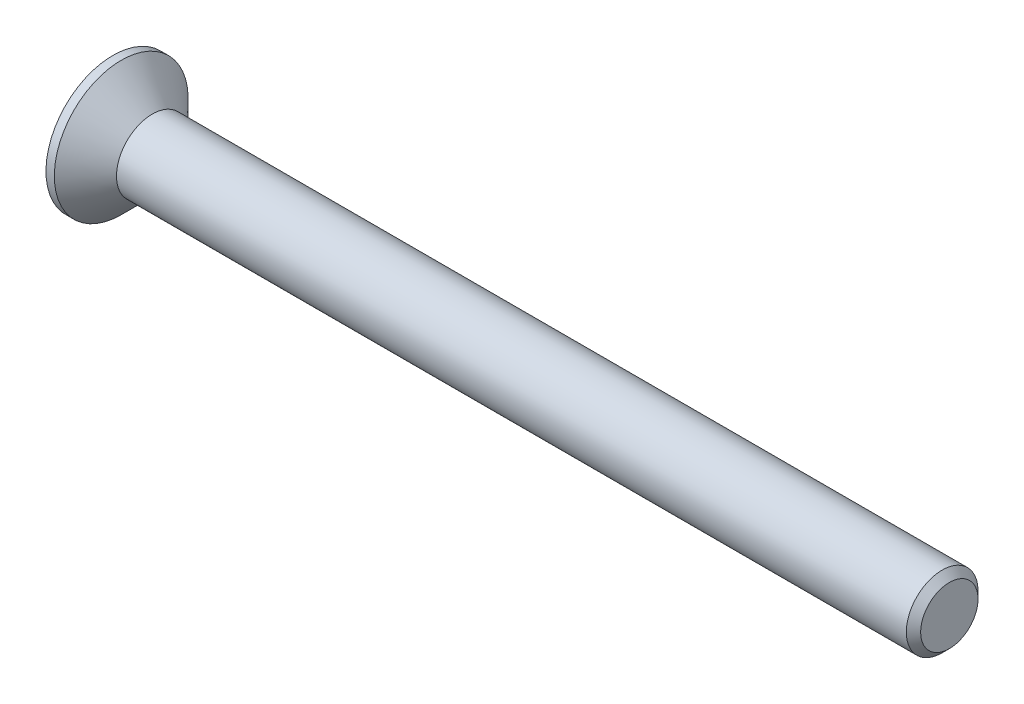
ISO-10303-21;
HEADER;
FILE_DESCRIPTION(('STEP AP214'),'2;1');
FILE_NAME('part.step','',(''),(''),'','','');
FILE_SCHEMA(('AUTOMOTIVE_DESIGN { 1 0 10303 214 1 1 1 1 }'));
ENDSEC;
DATA;
#1=APPLICATION_CONTEXT('core data for automotive mechanical design processes');
#2=APPLICATION_PROTOCOL_DEFINITION('international standard','automotive_design',2000,#1);
#3=PRODUCT_CONTEXT('',#1,'mechanical');
#4=PRODUCT('Part','Part','',(#3));
#5=PRODUCT_RELATED_PRODUCT_CATEGORY('part','',(#4));
#6=PRODUCT_DEFINITION_FORMATION('','',#4);
#7=PRODUCT_DEFINITION_CONTEXT('part definition',#1,'design');
#8=PRODUCT_DEFINITION('design','',#6,#7);
#9=PRODUCT_DEFINITION_SHAPE('','',#8);
#10=(LENGTH_UNIT() NAMED_UNIT(*) SI_UNIT(.MILLI.,.METRE.));
#11=(NAMED_UNIT(*) PLANE_ANGLE_UNIT() SI_UNIT($,.RADIAN.));
#12=(NAMED_UNIT(*) SI_UNIT($,.STERADIAN.) SOLID_ANGLE_UNIT());
#13=UNCERTAINTY_MEASURE_WITH_UNIT(LENGTH_MEASURE(1.E-05),#10,'distance_accuracy_value','');
#14=(GEOMETRIC_REPRESENTATION_CONTEXT(3) GLOBAL_UNCERTAINTY_ASSIGNED_CONTEXT((#13)) GLOBAL_UNIT_ASSIGNED_CONTEXT((#10,
#11,#12)) REPRESENTATION_CONTEXT('',''));
#15=CARTESIAN_POINT('',(0.,0.,0.));
#16=DIRECTION('',(0.,0.,1.));
#17=DIRECTION('',(1.,0.,0.));
#18=AXIS2_PLACEMENT_3D('',#15,#16,#17);
#19=CARTESIAN_POINT('',(0.,0.,0.));
#20=DIRECTION('',(-1.,0.,0.));
#21=DIRECTION('',(0.,-1.,0.));
#22=AXIS2_PLACEMENT_3D('',#19,#20,#21);
#23=CONICAL_SURFACE('',#22,1.5,0.78539816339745);
#24=CARTESIAN_POINT('',(-1.3,0.,0.));
#25=DIRECTION('',(-1.,0.,0.));
#26=DIRECTION('',(0.,-1.,0.));
#27=AXIS2_PLACEMENT_3D('',#24,#25,#26);
#28=CIRCLE('',#27,2.8);
#29=CARTESIAN_POINT('',(-1.3,-2.8,0.));
#30=VERTEX_POINT('',#29);
#31=EDGE_CURVE('E189',#30,#30,#28,.T.);
#32=ORIENTED_EDGE('',*,*,#31,.F.);
#33=EDGE_LOOP('',(#32));
#34=FACE_BOUND('',#33,.T.);
#35=CARTESIAN_POINT('',(0.,0.,0.));
#36=DIRECTION('',(-1.,0.,0.));
#37=DIRECTION('',(0.,-1.,0.));
#38=AXIS2_PLACEMENT_3D('',#35,#36,#37);
#39=CIRCLE('',#38,1.5);
#40=CARTESIAN_POINT('',(0.,-1.5,0.));
#41=VERTEX_POINT('',#40);
#42=EDGE_CURVE('E212',#41,#41,#39,.T.);
#43=ORIENTED_EDGE('',*,*,#42,.T.);
#44=EDGE_LOOP('',(#43));
#45=FACE_BOUND('',#44,.T.);
#46=ADVANCED_FACE('F33',(#34,#45),#23,.T.);
#47=CARTESIAN_POINT('',(-1.65,0.,0.));
#48=DIRECTION('',(-1.,0.,0.));
#49=DIRECTION('',(0.,-1.,0.));
#50=AXIS2_PLACEMENT_3D('',#47,#48,#49);
#51=CYLINDRICAL_SURFACE('',#50,1.5);
#52=CARTESIAN_POINT('',(33.05,0.,0.));
#53=DIRECTION('',(-1.,0.,0.));
#54=DIRECTION('',(0.,-1.,0.));
#55=AXIS2_PLACEMENT_3D('',#52,#53,#54);
#56=CIRCLE('',#55,1.5);
#57=CARTESIAN_POINT('',(33.05,-1.5,0.));
#58=VERTEX_POINT('',#57);
#59=EDGE_CURVE('E41',#58,#58,#56,.T.);
#60=ORIENTED_EDGE('',*,*,#59,.T.);
#61=EDGE_LOOP('',(#60));
#62=FACE_BOUND('',#61,.T.);
#63=ORIENTED_EDGE('',*,*,#42,.F.);
#64=EDGE_LOOP('',(#63));
#65=FACE_BOUND('',#64,.T.);
#66=ADVANCED_FACE('F217',(#62,#65),#51,.T.);
#67=CARTESIAN_POINT('',(33.35,0.,0.));
#68=DIRECTION('',(-1.,0.,0.));
#69=DIRECTION('',(0.,-1.,0.));
#70=AXIS2_PLACEMENT_3D('',#67,#68,#69);
#71=PLANE('',#70);
#72=CARTESIAN_POINT('',(33.35,0.,0.));
#73=DIRECTION('',(-1.,0.,0.));
#74=DIRECTION('',(0.,-1.,0.));
#75=AXIS2_PLACEMENT_3D('',#72,#73,#74);
#76=CIRCLE('',#75,1.20000000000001);
#77=CARTESIAN_POINT('',(33.35,-1.20000000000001,0.));
#78=VERTEX_POINT('',#77);
#79=EDGE_CURVE('E11',#78,#78,#76,.F.);
#80=ORIENTED_EDGE('',*,*,#79,.T.);
#81=EDGE_LOOP('',(#80));
#82=FACE_BOUND('',#81,.T.);
#83=ADVANCED_FACE('F239',(#82),#71,.F.);
#84=CARTESIAN_POINT('',(-1.65,2.8,0.));
#85=DIRECTION('',(1.,0.,0.));
#86=DIRECTION('',(0.,1.,0.));
#87=AXIS2_PLACEMENT_3D('',#84,#85,#86);
#88=PLANE('',#87);
#89=DIRECTION('',(0.,0.,-1.));
#90=VECTOR('',#89,1.);
#91=CARTESIAN_POINT('',(-1.65,0.365,-1.45));
#92=LINE('',#91,#90);
#93=CARTESIAN_POINT('',(-1.65,0.365,-0.365));
#94=VERTEX_POINT('',#93);
#95=CARTESIAN_POINT('',(-1.65,0.365,-1.45));
#96=VERTEX_POINT('',#95);
#97=EDGE_CURVE('E158',#94,#96,#92,.T.);
#98=ORIENTED_EDGE('',*,*,#97,.F.);
#99=DIRECTION('',(0.,-1.,0.));
#100=VECTOR('',#99,1.);
#101=CARTESIAN_POINT('',(-1.65,0.365,-0.365));
#102=LINE('',#101,#100);
#103=CARTESIAN_POINT('',(-1.65,1.45,-0.365));
#104=VERTEX_POINT('',#103);
#105=EDGE_CURVE('E48',#104,#94,#102,.T.);
#106=ORIENTED_EDGE('',*,*,#105,.F.);
#107=DIRECTION('',(0.,0.,-1.));
#108=VECTOR('',#107,1.);
#109=CARTESIAN_POINT('',(-1.65,1.45,-0.365));
#110=LINE('',#109,#108);
#111=CARTESIAN_POINT('',(-1.65,1.45,0.365));
#112=VERTEX_POINT('',#111);
#113=EDGE_CURVE('E185',#112,#104,#110,.T.);
#114=ORIENTED_EDGE('',*,*,#113,.F.);
#115=DIRECTION('',(0.,1.,0.));
#116=VECTOR('',#115,1.);
#117=CARTESIAN_POINT('',(-1.65,1.45,0.365));
#118=LINE('',#117,#116);
#119=CARTESIAN_POINT('',(-1.65,0.365,0.365));
#120=VERTEX_POINT('',#119);
#121=EDGE_CURVE('E183',#120,#112,#118,.T.);
#122=ORIENTED_EDGE('',*,*,#121,.F.);
#123=DIRECTION('',(0.,0.,-1.));
#124=VECTOR('',#123,1.);
#125=CARTESIAN_POINT('',(-1.65,0.365,0.365));
#126=LINE('',#125,#124);
#127=CARTESIAN_POINT('',(-1.65,0.365,1.45));
#128=VERTEX_POINT('',#127);
#129=EDGE_CURVE('E132',#128,#120,#126,.T.);
#130=ORIENTED_EDGE('',*,*,#129,.F.);
#131=DIRECTION('',(0.,1.,0.));
#132=VECTOR('',#131,1.);
#133=CARTESIAN_POINT('',(-1.65,0.365,1.45));
#134=LINE('',#133,#132);
#135=CARTESIAN_POINT('',(-1.65,-0.365,1.45));
#136=VERTEX_POINT('',#135);
#137=EDGE_CURVE('E179',#136,#128,#134,.T.);
#138=ORIENTED_EDGE('',*,*,#137,.F.);
#139=DIRECTION('',(0.,0.,1.));
#140=VECTOR('',#139,1.);
#141=CARTESIAN_POINT('',(-1.65,-0.365,1.45));
#142=LINE('',#141,#140);
#143=CARTESIAN_POINT('',(-1.65,-0.365,0.365));
#144=VERTEX_POINT('',#143);
#145=EDGE_CURVE('E176',#144,#136,#142,.T.);
#146=ORIENTED_EDGE('',*,*,#145,.F.);
#147=DIRECTION('',(0.,1.,0.));
#148=VECTOR('',#147,1.);
#149=CARTESIAN_POINT('',(-1.65,-0.365,0.365));
#150=LINE('',#149,#148);
#151=CARTESIAN_POINT('',(-1.65,-1.45,0.365));
#152=VERTEX_POINT('',#151);
#153=EDGE_CURVE('E173',#152,#144,#150,.T.);
#154=ORIENTED_EDGE('',*,*,#153,.F.);
#155=DIRECTION('',(0.,0.,1.));
#156=VECTOR('',#155,1.);
#157=CARTESIAN_POINT('',(-1.65,-1.45,0.365));
#158=LINE('',#157,#156);
#159=CARTESIAN_POINT('',(-1.65,-1.45,-0.365));
#160=VERTEX_POINT('',#159);
#161=EDGE_CURVE('E170',#160,#152,#158,.T.);
#162=ORIENTED_EDGE('',*,*,#161,.F.);
#163=DIRECTION('',(0.,-1.,0.));
#164=VECTOR('',#163,1.);
#165=CARTESIAN_POINT('',(-1.65,-1.45,-0.365));
#166=LINE('',#165,#164);
#167=CARTESIAN_POINT('',(-1.65,-0.365,-0.365));
#168=VERTEX_POINT('',#167);
#169=EDGE_CURVE('E167',#168,#160,#166,.T.);
#170=ORIENTED_EDGE('',*,*,#169,.F.);
#171=DIRECTION('',(0.,0.,1.));
#172=VECTOR('',#171,1.);
#173=CARTESIAN_POINT('',(-1.65,-0.365,-0.365));
#174=LINE('',#173,#172);
#175=CARTESIAN_POINT('',(-1.65,-0.365,-1.45));
#176=VERTEX_POINT('',#175);
#177=EDGE_CURVE('E164',#176,#168,#174,.T.);
#178=ORIENTED_EDGE('',*,*,#177,.F.);
#179=DIRECTION('',(0.,-1.,0.));
#180=VECTOR('',#179,1.);
#181=CARTESIAN_POINT('',(-1.65,-0.365,-1.45));
#182=LINE('',#181,#180);
#183=EDGE_CURVE('E161',#96,#176,#182,.T.);
#184=ORIENTED_EDGE('',*,*,#183,.F.);
#185=EDGE_LOOP('',(#98,#106,#114,#122,#130,#138,#146,#154,#162,#170,#178,#184));
#186=FACE_BOUND('',#185,.T.);
#187=CARTESIAN_POINT('',(-1.65,0.,0.));
#188=DIRECTION('',(-1.,0.,0.));
#189=DIRECTION('',(0.,-1.,0.));
#190=AXIS2_PLACEMENT_3D('',#187,#188,#189);
#191=CIRCLE('',#190,2.8);
#192=CARTESIAN_POINT('',(-1.65,-2.8,0.));
#193=VERTEX_POINT('',#192);
#194=EDGE_CURVE('E209',#193,#193,#191,.T.);
#195=ORIENTED_EDGE('',*,*,#194,.T.);
#196=EDGE_LOOP('',(#195));
#197=FACE_BOUND('',#196,.T.);
#198=ADVANCED_FACE('F230',(#186,#197),#88,.F.);
#199=CARTESIAN_POINT('',(-1.65,0.,0.));
#200=DIRECTION('',(-1.,0.,0.));
#201=DIRECTION('',(0.,-1.,0.));
#202=AXIS2_PLACEMENT_3D('',#199,#200,#201);
#203=CYLINDRICAL_SURFACE('',#202,2.8);
#204=ORIENTED_EDGE('',*,*,#194,.F.);
#205=EDGE_LOOP('',(#204));
#206=FACE_BOUND('',#205,.T.);
#207=ORIENTED_EDGE('',*,*,#31,.T.);
#208=EDGE_LOOP('',(#207));
#209=FACE_BOUND('',#208,.T.);
#210=ADVANCED_FACE('F222',(#206,#209),#203,.T.);
#211=CARTESIAN_POINT('',(33.05,0.,0.));
#212=DIRECTION('',(-1.,0.,0.));
#213=DIRECTION('',(0.,-1.,0.));
#214=AXIS2_PLACEMENT_3D('',#211,#212,#213);
#215=CONICAL_SURFACE('',#214,1.5,0.785398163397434);
#216=ORIENTED_EDGE('',*,*,#79,.F.);
#217=EDGE_LOOP('',(#216));
#218=FACE_BOUND('',#217,.T.);
#219=ORIENTED_EDGE('',*,*,#59,.F.);
#220=EDGE_LOOP('',(#219));
#221=FACE_BOUND('',#220,.T.);
#222=ADVANCED_FACE('F35',(#218,#221),#215,.T.);
#223=CARTESIAN_POINT('',(-0.4,0.365,-0.365));
#224=DIRECTION('',(0.,0.,-1.));
#225=DIRECTION('',(-1.,0.,0.));
#226=AXIS2_PLACEMENT_3D('',#223,#224,#225);
#227=PLANE('',#226);
#228=ORIENTED_EDGE('',*,*,#105,.T.);
#229=DIRECTION('',(-1.,0.,0.));
#230=VECTOR('',#229,1.);
#231=CARTESIAN_POINT('',(-0.4,0.365,-0.365));
#232=LINE('',#231,#230);
#233=CARTESIAN_POINT('',(-0.4,0.365,-0.365));
#234=VERTEX_POINT('',#233);
#235=EDGE_CURVE('E96',#234,#94,#232,.T.);
#236=ORIENTED_EDGE('',*,*,#235,.F.);
#237=DIRECTION('',(0.,-1.,0.));
#238=VECTOR('',#237,1.);
#239=CARTESIAN_POINT('',(-0.4,0.365,-0.365));
#240=LINE('',#239,#238);
#241=CARTESIAN_POINT('',(-0.4,1.45,-0.365));
#242=VERTEX_POINT('',#241);
#243=EDGE_CURVE('E187',#242,#234,#240,.T.);
#244=ORIENTED_EDGE('',*,*,#243,.F.);
#245=DIRECTION('',(-1.,0.,0.));
#246=VECTOR('',#245,1.);
#247=CARTESIAN_POINT('',(-0.4,1.45,-0.365));
#248=LINE('',#247,#246);
#249=EDGE_CURVE('E56',#242,#104,#248,.T.);
#250=ORIENTED_EDGE('',*,*,#249,.T.);
#251=EDGE_LOOP('',(#228,#236,#244,#250));
#252=FACE_BOUND('',#251,.T.);
#253=ADVANCED_FACE('F221',(#252),#227,.F.);
#254=CARTESIAN_POINT('',(-0.4,1.45,-0.365));
#255=DIRECTION('',(0.,1.,0.));
#256=DIRECTION('',(-1.,0.,0.));
#257=AXIS2_PLACEMENT_3D('',#254,#255,#256);
#258=PLANE('',#257);
#259=ORIENTED_EDGE('',*,*,#113,.T.);
#260=ORIENTED_EDGE('',*,*,#249,.F.);
#261=DIRECTION('',(0.,0.,-1.));
#262=VECTOR('',#261,1.);
#263=CARTESIAN_POINT('',(-0.4,1.45,-0.365));
#264=LINE('',#263,#262);
#265=CARTESIAN_POINT('',(-0.4,1.45,0.365));
#266=VERTEX_POINT('',#265);
#267=EDGE_CURVE('E144',#266,#242,#264,.T.);
#268=ORIENTED_EDGE('',*,*,#267,.F.);
#269=DIRECTION('',(-1.,0.,0.));
#270=VECTOR('',#269,1.);
#271=CARTESIAN_POINT('',(-0.4,1.45,0.365));
#272=LINE('',#271,#270);
#273=EDGE_CURVE('E136',#266,#112,#272,.T.);
#274=ORIENTED_EDGE('',*,*,#273,.T.);
#275=EDGE_LOOP('',(#259,#260,#268,#274));
#276=FACE_BOUND('',#275,.T.);
#277=ADVANCED_FACE('F228',(#276),#258,.F.);
#278=CARTESIAN_POINT('',(-0.4,1.45,0.365));
#279=DIRECTION('',(0.,0.,1.));
#280=DIRECTION('',(1.,0.,0.));
#281=AXIS2_PLACEMENT_3D('',#278,#279,#280);
#282=PLANE('',#281);
#283=ORIENTED_EDGE('',*,*,#121,.T.);
#284=ORIENTED_EDGE('',*,*,#273,.F.);
#285=DIRECTION('',(0.,1.,0.));
#286=VECTOR('',#285,1.);
#287=CARTESIAN_POINT('',(-0.4,1.45,0.365));
#288=LINE('',#287,#286);
#289=CARTESIAN_POINT('',(-0.4,0.365,0.365));
#290=VERTEX_POINT('',#289);
#291=EDGE_CURVE('E140',#290,#266,#288,.T.);
#292=ORIENTED_EDGE('',*,*,#291,.F.);
#293=DIRECTION('',(-1.,0.,0.));
#294=VECTOR('',#293,1.);
#295=CARTESIAN_POINT('',(-0.4,0.365,0.365));
#296=LINE('',#295,#294);
#297=EDGE_CURVE('E125',#290,#120,#296,.T.);
#298=ORIENTED_EDGE('',*,*,#297,.T.);
#299=EDGE_LOOP('',(#283,#284,#292,#298));
#300=FACE_BOUND('',#299,.T.);
#301=ADVANCED_FACE('F141',(#300),#282,.F.);
#302=CARTESIAN_POINT('',(-0.4,0.365,0.365));
#303=DIRECTION('',(0.,1.,0.));
#304=DIRECTION('',(-1.,0.,0.));
#305=AXIS2_PLACEMENT_3D('',#302,#303,#304);
#306=PLANE('',#305);
#307=ORIENTED_EDGE('',*,*,#129,.T.);
#308=ORIENTED_EDGE('',*,*,#297,.F.);
#309=DIRECTION('',(0.,0.,-1.));
#310=VECTOR('',#309,1.);
#311=CARTESIAN_POINT('',(-0.4,0.365,0.365));
#312=LINE('',#311,#310);
#313=CARTESIAN_POINT('',(-0.4,0.365,1.45));
#314=VERTEX_POINT('',#313);
#315=EDGE_CURVE('E129',#314,#290,#312,.T.);
#316=ORIENTED_EDGE('',*,*,#315,.F.);
#317=DIRECTION('',(-1.,0.,0.));
#318=VECTOR('',#317,1.);
#319=CARTESIAN_POINT('',(-0.4,0.365,1.45));
#320=LINE('',#319,#318);
#321=EDGE_CURVE('E137',#314,#128,#320,.T.);
#322=ORIENTED_EDGE('',*,*,#321,.T.);
#323=EDGE_LOOP('',(#307,#308,#316,#322));
#324=FACE_BOUND('',#323,.T.);
#325=ADVANCED_FACE('F127',(#324),#306,.F.);
#326=CARTESIAN_POINT('',(-0.4,0.365,1.45));
#327=DIRECTION('',(0.,0.,1.));
#328=DIRECTION('',(1.,0.,0.));
#329=AXIS2_PLACEMENT_3D('',#326,#327,#328);
#330=PLANE('',#329);
#331=ORIENTED_EDGE('',*,*,#137,.T.);
#332=ORIENTED_EDGE('',*,*,#321,.F.);
#333=DIRECTION('',(0.,1.,0.));
#334=VECTOR('',#333,1.);
#335=CARTESIAN_POINT('',(-0.4,0.365,1.45));
#336=LINE('',#335,#334);
#337=CARTESIAN_POINT('',(-0.4,-0.365,1.45));
#338=VERTEX_POINT('',#337);
#339=EDGE_CURVE('E150',#338,#314,#336,.T.);
#340=ORIENTED_EDGE('',*,*,#339,.F.);
#341=DIRECTION('',(-1.,0.,0.));
#342=VECTOR('',#341,1.);
#343=CARTESIAN_POINT('',(-0.4,-0.365,1.45));
#344=LINE('',#343,#342);
#345=EDGE_CURVE('E192',#338,#136,#344,.T.);
#346=ORIENTED_EDGE('',*,*,#345,.T.);
#347=EDGE_LOOP('',(#331,#332,#340,#346));
#348=FACE_BOUND('',#347,.T.);
#349=ADVANCED_FACE('F277',(#348),#330,.F.);
#350=CARTESIAN_POINT('',(-0.4,-0.365,1.45));
#351=DIRECTION('',(0.,-1.,0.));
#352=DIRECTION('',(1.,0.,0.));
#353=AXIS2_PLACEMENT_3D('',#350,#351,#352);
#354=PLANE('',#353);
#355=ORIENTED_EDGE('',*,*,#145,.T.);
#356=ORIENTED_EDGE('',*,*,#345,.F.);
#357=DIRECTION('',(0.,0.,1.));
#358=VECTOR('',#357,1.);
#359=CARTESIAN_POINT('',(-0.4,-0.365,1.45));
#360=LINE('',#359,#358);
#361=CARTESIAN_POINT('',(-0.4,-0.365,0.365));
#362=VERTEX_POINT('',#361);
#363=EDGE_CURVE('E152',#362,#338,#360,.T.);
#364=ORIENTED_EDGE('',*,*,#363,.F.);
#365=DIRECTION('',(-1.,0.,0.));
#366=VECTOR('',#365,1.);
#367=CARTESIAN_POINT('',(-0.4,-0.365,0.365));
#368=LINE('',#367,#366);
#369=EDGE_CURVE('E194',#362,#144,#368,.T.);
#370=ORIENTED_EDGE('',*,*,#369,.T.);
#371=EDGE_LOOP('',(#355,#356,#364,#370));
#372=FACE_BOUND('',#371,.T.);
#373=ADVANCED_FACE('F273',(#372),#354,.F.);
#374=CARTESIAN_POINT('',(-0.4,-0.365,0.365));
#375=DIRECTION('',(0.,0.,1.));
#376=DIRECTION('',(1.,0.,0.));
#377=AXIS2_PLACEMENT_3D('',#374,#375,#376);
#378=PLANE('',#377);
#379=ORIENTED_EDGE('',*,*,#153,.T.);
#380=ORIENTED_EDGE('',*,*,#369,.F.);
#381=DIRECTION('',(0.,1.,0.));
#382=VECTOR('',#381,1.);
#383=CARTESIAN_POINT('',(-0.4,-0.365,0.365));
#384=LINE('',#383,#382);
#385=CARTESIAN_POINT('',(-0.4,-1.45,0.365));
#386=VERTEX_POINT('',#385);
#387=EDGE_CURVE('E422',#386,#362,#384,.T.);
#388=ORIENTED_EDGE('',*,*,#387,.F.);
#389=DIRECTION('',(-1.,0.,0.));
#390=VECTOR('',#389,1.);
#391=CARTESIAN_POINT('',(-0.4,-1.45,0.365));
#392=LINE('',#391,#390);
#393=EDGE_CURVE('E196',#386,#152,#392,.T.);
#394=ORIENTED_EDGE('',*,*,#393,.T.);
#395=EDGE_LOOP('',(#379,#380,#388,#394));
#396=FACE_BOUND('',#395,.T.);
#397=ADVANCED_FACE('F269',(#396),#378,.F.);
#398=CARTESIAN_POINT('',(-0.4,-1.45,0.365));
#399=DIRECTION('',(0.,-1.,0.));
#400=DIRECTION('',(1.,0.,0.));
#401=AXIS2_PLACEMENT_3D('',#398,#399,#400);
#402=PLANE('',#401);
#403=ORIENTED_EDGE('',*,*,#161,.T.);
#404=ORIENTED_EDGE('',*,*,#393,.F.);
#405=DIRECTION('',(0.,0.,1.));
#406=VECTOR('',#405,1.);
#407=CARTESIAN_POINT('',(-0.4,-1.45,0.365));
#408=LINE('',#407,#406);
#409=CARTESIAN_POINT('',(-0.4,-1.45,-0.365));
#410=VERTEX_POINT('',#409);
#411=EDGE_CURVE('E419',#410,#386,#408,.T.);
#412=ORIENTED_EDGE('',*,*,#411,.F.);
#413=DIRECTION('',(-1.,0.,0.));
#414=VECTOR('',#413,1.);
#415=CARTESIAN_POINT('',(-0.4,-1.45,-0.365));
#416=LINE('',#415,#414);
#417=EDGE_CURVE('E198',#410,#160,#416,.T.);
#418=ORIENTED_EDGE('',*,*,#417,.T.);
#419=EDGE_LOOP('',(#403,#404,#412,#418));
#420=FACE_BOUND('',#419,.T.);
#421=ADVANCED_FACE('F265',(#420),#402,.F.);
#422=CARTESIAN_POINT('',(-0.4,-1.45,-0.365));
#423=DIRECTION('',(0.,0.,-1.));
#424=DIRECTION('',(-1.,0.,0.));
#425=AXIS2_PLACEMENT_3D('',#422,#423,#424);
#426=PLANE('',#425);
#427=ORIENTED_EDGE('',*,*,#169,.T.);
#428=ORIENTED_EDGE('',*,*,#417,.F.);
#429=DIRECTION('',(0.,-1.,0.));
#430=VECTOR('',#429,1.);
#431=CARTESIAN_POINT('',(-0.4,-1.45,-0.365));
#432=LINE('',#431,#430);
#433=CARTESIAN_POINT('',(-0.4,-0.365,-0.365));
#434=VERTEX_POINT('',#433);
#435=EDGE_CURVE('E416',#434,#410,#432,.T.);
#436=ORIENTED_EDGE('',*,*,#435,.F.);
#437=DIRECTION('',(-1.,0.,0.));
#438=VECTOR('',#437,1.);
#439=CARTESIAN_POINT('',(-0.4,-0.365,-0.365));
#440=LINE('',#439,#438);
#441=EDGE_CURVE('E200',#434,#168,#440,.T.);
#442=ORIENTED_EDGE('',*,*,#441,.T.);
#443=EDGE_LOOP('',(#427,#428,#436,#442));
#444=FACE_BOUND('',#443,.T.);
#445=ADVANCED_FACE('F261',(#444),#426,.F.);
#446=CARTESIAN_POINT('',(-0.4,-0.365,-0.365));
#447=DIRECTION('',(0.,-1.,0.));
#448=DIRECTION('',(1.,0.,0.));
#449=AXIS2_PLACEMENT_3D('',#446,#447,#448);
#450=PLANE('',#449);
#451=ORIENTED_EDGE('',*,*,#177,.T.);
#452=ORIENTED_EDGE('',*,*,#441,.F.);
#453=DIRECTION('',(0.,0.,1.));
#454=VECTOR('',#453,1.);
#455=CARTESIAN_POINT('',(-0.4,-0.365,-0.365));
#456=LINE('',#455,#454);
#457=CARTESIAN_POINT('',(-0.4,-0.365,-1.45));
#458=VERTEX_POINT('',#457);
#459=EDGE_CURVE('E413',#458,#434,#456,.T.);
#460=ORIENTED_EDGE('',*,*,#459,.F.);
#461=DIRECTION('',(-1.,0.,0.));
#462=VECTOR('',#461,1.);
#463=CARTESIAN_POINT('',(-0.4,-0.365,-1.45));
#464=LINE('',#463,#462);
#465=EDGE_CURVE('E202',#458,#176,#464,.T.);
#466=ORIENTED_EDGE('',*,*,#465,.T.);
#467=EDGE_LOOP('',(#451,#452,#460,#466));
#468=FACE_BOUND('',#467,.T.);
#469=ADVANCED_FACE('F257',(#468),#450,.F.);
#470=CARTESIAN_POINT('',(-0.4,-0.365,-1.45));
#471=DIRECTION('',(0.,0.,-1.));
#472=DIRECTION('',(-1.,0.,0.));
#473=AXIS2_PLACEMENT_3D('',#470,#471,#472);
#474=PLANE('',#473);
#475=ORIENTED_EDGE('',*,*,#183,.T.);
#476=ORIENTED_EDGE('',*,*,#465,.F.);
#477=DIRECTION('',(0.,-1.,0.));
#478=VECTOR('',#477,1.);
#479=CARTESIAN_POINT('',(-0.4,-0.365,-1.45));
#480=LINE('',#479,#478);
#481=CARTESIAN_POINT('',(-0.4,0.365,-1.45));
#482=VERTEX_POINT('',#481);
#483=EDGE_CURVE('E408',#482,#458,#480,.T.);
#484=ORIENTED_EDGE('',*,*,#483,.F.);
#485=DIRECTION('',(-1.,0.,0.));
#486=VECTOR('',#485,1.);
#487=CARTESIAN_POINT('',(-0.4,0.365,-1.45));
#488=LINE('',#487,#486);
#489=EDGE_CURVE('E204',#482,#96,#488,.T.);
#490=ORIENTED_EDGE('',*,*,#489,.T.);
#491=EDGE_LOOP('',(#475,#476,#484,#490));
#492=FACE_BOUND('',#491,.T.);
#493=ADVANCED_FACE('F253',(#492),#474,.F.);
#494=CARTESIAN_POINT('',(-0.4,0.365,-1.45));
#495=DIRECTION('',(0.,1.,0.));
#496=DIRECTION('',(-1.,0.,0.));
#497=AXIS2_PLACEMENT_3D('',#494,#495,#496);
#498=PLANE('',#497);
#499=ORIENTED_EDGE('',*,*,#97,.T.);
#500=ORIENTED_EDGE('',*,*,#489,.F.);
#501=DIRECTION('',(0.,0.,-1.));
#502=VECTOR('',#501,1.);
#503=CARTESIAN_POINT('',(-0.4,0.365,-1.45));
#504=LINE('',#503,#502);
#505=EDGE_CURVE('E406',#234,#482,#504,.T.);
#506=ORIENTED_EDGE('',*,*,#505,.F.);
#507=ORIENTED_EDGE('',*,*,#235,.T.);
#508=EDGE_LOOP('',(#499,#500,#506,#507));
#509=FACE_BOUND('',#508,.T.);
#510=ADVANCED_FACE('F250',(#509),#498,.F.);
#511=CARTESIAN_POINT('',(-0.4,0.,0.));
#512=DIRECTION('',(1.,0.,0.));
#513=DIRECTION('',(0.,0.,-1.));
#514=AXIS2_PLACEMENT_3D('',#511,#512,#513);
#515=PLANE('',#514);
#516=ORIENTED_EDGE('',*,*,#243,.T.);
#517=ORIENTED_EDGE('',*,*,#505,.T.);
#518=ORIENTED_EDGE('',*,*,#483,.T.);
#519=ORIENTED_EDGE('',*,*,#459,.T.);
#520=ORIENTED_EDGE('',*,*,#435,.T.);
#521=ORIENTED_EDGE('',*,*,#411,.T.);
#522=ORIENTED_EDGE('',*,*,#387,.T.);
#523=ORIENTED_EDGE('',*,*,#363,.T.);
#524=ORIENTED_EDGE('',*,*,#339,.T.);
#525=ORIENTED_EDGE('',*,*,#315,.T.);
#526=ORIENTED_EDGE('',*,*,#291,.T.);
#527=ORIENTED_EDGE('',*,*,#267,.T.);
#528=EDGE_LOOP('',(#516,#517,#518,#519,#520,#521,#522,#523,#524,#525,#526,#527));
#529=FACE_BOUND('',#528,.T.);
#530=ADVANCED_FACE('F147',(#529),#515,.F.);
#531=CLOSED_SHELL('',(#46,#66,#83,#198,#210,#222,#253,#277,#301,#325,#349,#373,#397,#421,#445,
#469,#493,#510,#530));
#532=MANIFOLD_SOLID_BREP('B2',#531);
#533=ADVANCED_BREP_SHAPE_REPRESENTATION('',(#18,#532),#14);
#534=SHAPE_DEFINITION_REPRESENTATION(#9,#533);
ENDSEC;
END-ISO-10303-21;
